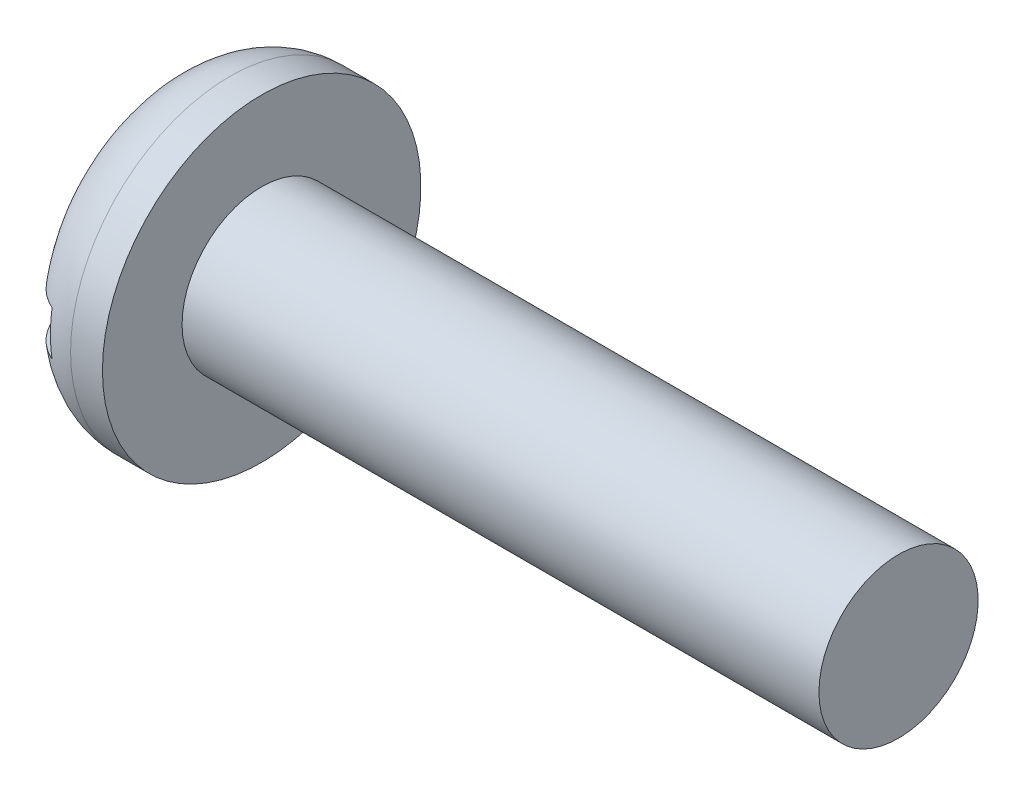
ISO-10303-21;
HEADER;
FILE_DESCRIPTION(('STEP AP214'),'2;1');
FILE_NAME('part.step','',(''),(''),'','','');
FILE_SCHEMA(('AUTOMOTIVE_DESIGN { 1 0 10303 214 1 1 1 1 }'));
ENDSEC;
DATA;
#1=APPLICATION_CONTEXT('core data for automotive mechanical design processes');
#2=APPLICATION_PROTOCOL_DEFINITION('international standard','automotive_design',2000,#1);
#3=PRODUCT_CONTEXT('',#1,'mechanical');
#4=PRODUCT('Part','Part','',(#3));
#5=PRODUCT_RELATED_PRODUCT_CATEGORY('part','',(#4));
#6=PRODUCT_DEFINITION_FORMATION('','',#4);
#7=PRODUCT_DEFINITION_CONTEXT('part definition',#1,'design');
#8=PRODUCT_DEFINITION('design','',#6,#7);
#9=PRODUCT_DEFINITION_SHAPE('','',#8);
#10=(LENGTH_UNIT() NAMED_UNIT(*) SI_UNIT(.MILLI.,.METRE.));
#11=(NAMED_UNIT(*) PLANE_ANGLE_UNIT() SI_UNIT($,.RADIAN.));
#12=(NAMED_UNIT(*) SI_UNIT($,.STERADIAN.) SOLID_ANGLE_UNIT());
#13=UNCERTAINTY_MEASURE_WITH_UNIT(LENGTH_MEASURE(1.E-05),#10,'distance_accuracy_value','');
#14=(GEOMETRIC_REPRESENTATION_CONTEXT(3) GLOBAL_UNCERTAINTY_ASSIGNED_CONTEXT((#13)) GLOBAL_UNIT_ASSIGNED_CONTEXT((#10,
#11,#12)) REPRESENTATION_CONTEXT('',''));
#15=CARTESIAN_POINT('',(0.,0.,0.));
#16=DIRECTION('',(0.,0.,1.));
#17=DIRECTION('',(1.,0.,0.));
#18=AXIS2_PLACEMENT_3D('',#15,#16,#17);
#19=CARTESIAN_POINT('',(0.,0.,0.));
#20=DIRECTION('',(-1.,0.,0.));
#21=DIRECTION('',(0.,0.,1.));
#22=AXIS2_PLACEMENT_3D('',#19,#20,#21);
#23=PLANE('',#22);
#24=DIRECTION('',(0.,0.,-1.));
#25=VECTOR('',#24,1.);
#26=CARTESIAN_POINT('',(0.,1.4,10.));
#27=LINE('',#26,#25);
#28=CARTESIAN_POINT('',(0.,1.4,5.83438085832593));
#29=VERTEX_POINT('',#28);
#30=CARTESIAN_POINT('',(0.,1.4,-5.83438085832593));
#31=VERTEX_POINT('',#30);
#32=EDGE_CURVE('E91',#29,#31,#27,.T.);
#33=ORIENTED_EDGE('',*,*,#32,.F.);
#34=CARTESIAN_POINT('',(0.,0.,0.));
#35=DIRECTION('',(-1.,0.,0.));
#36=DIRECTION('',(0.,0.,1.));
#37=AXIS2_PLACEMENT_3D('',#34,#35,#36);
#38=CIRCLE('',#37,6.);
#39=EDGE_CURVE('E97',#29,#31,#38,.T.);
#40=ORIENTED_EDGE('',*,*,#39,.T.);
#41=EDGE_LOOP('',(#33,#40));
#42=FACE_BOUND('',#41,.T.);
#43=ADVANCED_FACE('F33',(#42),#23,.T.);
#44=CARTESIAN_POINT('',(-25.4,0.,0.));
#45=DIRECTION('',(-1.,0.,0.));
#46=DIRECTION('',(0.,0.,1.));
#47=AXIS2_PLACEMENT_3D('',#44,#45,#46);
#48=CYLINDRICAL_SURFACE('',#47,5.);
#49=CARTESIAN_POINT('',(46.,0.,0.));
#50=DIRECTION('',(-1.,0.,0.));
#51=DIRECTION('',(0.,0.,1.));
#52=AXIS2_PLACEMENT_3D('',#49,#50,#51);
#53=CIRCLE('',#52,5.);
#54=CARTESIAN_POINT('',(46.,0.,5.));
#55=VERTEX_POINT('',#54);
#56=EDGE_CURVE('E101',#55,#55,#53,.T.);
#57=ORIENTED_EDGE('',*,*,#56,.T.);
#58=EDGE_LOOP('',(#57));
#59=FACE_BOUND('',#58,.T.);
#60=CARTESIAN_POINT('',(6.,0.,0.));
#61=DIRECTION('',(-1.,0.,0.));
#62=DIRECTION('',(0.,0.,1.));
#63=AXIS2_PLACEMENT_3D('',#60,#61,#62);
#64=CIRCLE('',#63,5.);
#65=CARTESIAN_POINT('',(6.,0.,5.));
#66=VERTEX_POINT('',#65);
#67=EDGE_CURVE('E136',#66,#66,#64,.T.);
#68=ORIENTED_EDGE('',*,*,#67,.F.);
#69=EDGE_LOOP('',(#68));
#70=FACE_BOUND('',#69,.T.);
#71=ADVANCED_FACE('F35',(#59,#70),#48,.T.);
#72=CARTESIAN_POINT('',(46.,5.,0.));
#73=DIRECTION('',(1.,0.,0.));
#74=DIRECTION('',(0.,0.,-1.));
#75=AXIS2_PLACEMENT_3D('',#72,#73,#74);
#76=PLANE('',#75);
#77=ORIENTED_EDGE('',*,*,#56,.F.);
#78=EDGE_LOOP('',(#77));
#79=FACE_BOUND('',#78,.T.);
#80=ADVANCED_FACE('F155',(#79),#76,.T.);
#81=DIRECTION('',(0.,0.,1.));
#82=VECTOR('',#81,1.);
#83=CARTESIAN_POINT('',(0.,-1.4,-10.));
#84=LINE('',#83,#82);
#85=CARTESIAN_POINT('',(0.,-1.4,-5.83438085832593));
#86=VERTEX_POINT('',#85);
#87=CARTESIAN_POINT('',(0.,-1.4,5.83438085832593));
#88=VERTEX_POINT('',#87);
#89=EDGE_CURVE('E79',#86,#88,#84,.T.);
#90=ORIENTED_EDGE('',*,*,#89,.F.);
#91=EDGE_CURVE('E90',#86,#88,#38,.T.);
#92=ORIENTED_EDGE('',*,*,#91,.T.);
#93=EDGE_LOOP('',(#90,#92));
#94=FACE_BOUND('',#93,.T.);
#95=ADVANCED_FACE('F89',(#94),#23,.T.);
#96=CARTESIAN_POINT('',(4.,0.,0.));
#97=DIRECTION('',(-1.,0.,0.));
#98=DIRECTION('',(0.,0.,1.));
#99=AXIS2_PLACEMENT_3D('',#96,#97,#98);
#100=TOROIDAL_SURFACE('',#99,6.,4.);
#101=CARTESIAN_POINT('',(2.82388760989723,1.4,1.66688763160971));
#102=CARTESIAN_POINT('',(2.99591057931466,1.4,1.59780455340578));
#103=CARTESIAN_POINT('',(3.17324641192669,1.4,1.54138487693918));
#104=CARTESIAN_POINT('',(3.44431983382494,1.4,1.48071678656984));
#105=CARTESIAN_POINT('',(3.53545417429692,1.4,1.46449078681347));
#106=CARTESIAN_POINT('',(3.71886318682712,1.4,1.44064962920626));
#107=CARTESIAN_POINT('',(3.81113770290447,1.4,1.43303330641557));
#108=CARTESIAN_POINT('',(3.99350456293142,1.4,1.42687715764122));
#109=CARTESIAN_POINT('',(4.08358896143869,1.4,1.4280990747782));
#110=CARTESIAN_POINT('',(4.26324158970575,1.4,1.43899537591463));
#111=CARTESIAN_POINT('',(4.3528098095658,1.4,1.44866992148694));
#112=CARTESIAN_POINT('',(4.5308965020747,1.4,1.47606318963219));
#113=CARTESIAN_POINT('',(4.61941221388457,1.4,1.49379966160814));
#114=CARTESIAN_POINT('',(4.79464932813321,1.4,1.53664349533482));
#115=CARTESIAN_POINT('',(4.88137015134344,1.4,1.56175319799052));
#116=CARTESIAN_POINT('',(5.07409548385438,1.4,1.62572381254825));
#117=CARTESIAN_POINT('',(5.17947939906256,1.4,1.66645421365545));
#118=CARTESIAN_POINT('',(5.38629884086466,1.4,1.75692315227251));
#119=CARTESIAN_POINT('',(5.48773323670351,1.4,1.80666424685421));
#120=CARTESIAN_POINT('',(5.68639921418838,1.4,1.9141326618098));
#121=CARTESIAN_POINT('',(5.78362651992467,1.4,1.97186786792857));
#122=CARTESIAN_POINT('',(5.97343201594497,1.4,2.09445578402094));
#123=CARTESIAN_POINT('',(6.06601059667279,1.4,2.15930789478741));
#124=CARTESIAN_POINT('',(6.3410225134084,1.4,2.36717873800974));
#125=CARTESIAN_POINT('',(6.51565728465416,1.4,2.52072958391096));
#126=CARTESIAN_POINT('',(6.84075526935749,1.4,2.85122113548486));
#127=CARTESIAN_POINT('',(6.991232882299,1.4,3.02814779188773));
#128=CARTESIAN_POINT('',(7.28585358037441,1.4,3.43133954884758));
#129=CARTESIAN_POINT('',(7.42540235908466,1.4,3.66100173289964));
#130=CARTESIAN_POINT('',(7.6621109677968,1.4,4.14138729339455));
#131=CARTESIAN_POINT('',(7.75925712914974,1.4,4.39211743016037));
#132=CARTESIAN_POINT('',(7.90345477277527,1.4,4.896570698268));
#133=CARTESIAN_POINT('',(7.95238998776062,1.4,5.14975345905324));
#134=CARTESIAN_POINT('',(8.0041504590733,1.4,5.66077776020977));
#135=CARTESIAN_POINT('',(8.00699532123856,1.4,5.91861727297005));
#136=CARTESIAN_POINT('',(7.96674840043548,1.4,6.41533887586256));
#137=CARTESIAN_POINT('',(7.92635894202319,1.4,6.65444141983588));
#138=CARTESIAN_POINT('',(7.80439510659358,1.4,7.12191135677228));
#139=CARTESIAN_POINT('',(7.72282979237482,1.4,7.35028109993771));
#140=CARTESIAN_POINT('',(7.52443658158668,1.4,7.78063057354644));
#141=CARTESIAN_POINT('',(7.40906711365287,1.4,7.98328350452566));
#142=CARTESIAN_POINT('',(7.14522379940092,1.4,8.36575641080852));
#143=CARTESIAN_POINT('',(6.99675450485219,1.4,8.54557952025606));
#144=CARTESIAN_POINT('',(6.67451507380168,1.4,8.87321576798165));
#145=CARTESIAN_POINT('',(6.50136764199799,1.4,9.02164171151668));
#146=CARTESIAN_POINT('',(6.13235201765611,1.4,9.28688671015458));
#147=CARTESIAN_POINT('',(5.93648551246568,1.4,9.40370811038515));
#148=CARTESIAN_POINT('',(5.53018839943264,1.4,9.60100138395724));
#149=CARTESIAN_POINT('',(5.31996441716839,1.4,9.68189897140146));
#150=CARTESIAN_POINT('',(4.88887041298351,1.4,9.80700967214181));
#151=CARTESIAN_POINT('',(4.66800081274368,1.4,9.85122423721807));
#152=CARTESIAN_POINT('',(4.22332236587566,1.4,9.90150065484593));
#153=CARTESIAN_POINT('',(3.99953945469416,1.4,9.907792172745));
#154=CARTESIAN_POINT('',(3.55410513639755,1.4,9.88265209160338));
#155=CARTESIAN_POINT('',(3.33245369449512,1.4,9.85122110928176));
#156=CARTESIAN_POINT('',(2.89792053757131,1.4,9.75163965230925));
#157=CARTESIAN_POINT('',(2.68502592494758,1.4,9.68354542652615));
#158=CARTESIAN_POINT('',(2.27364991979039,1.4,9.51267018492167));
#159=CARTESIAN_POINT('',(2.07516856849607,1.4,9.40988906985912));
#160=CARTESIAN_POINT('',(1.69766712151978,1.4,9.17232718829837));
#161=CARTESIAN_POINT('',(1.51869880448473,1.4,9.03746416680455));
#162=CARTESIAN_POINT('',(1.18574635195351,1.4,8.7398042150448));
#163=CARTESIAN_POINT('',(1.03176275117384,1.4,8.57700668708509));
#164=CARTESIAN_POINT('',(0.751887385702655,1.4,8.2268843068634));
#165=CARTESIAN_POINT('',(0.626208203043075,1.4,8.03938958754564));
#166=CARTESIAN_POINT('',(0.407636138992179,1.4,7.64619129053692));
#167=CARTESIAN_POINT('',(0.314744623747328,1.4,7.44048695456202));
#168=CARTESIAN_POINT('',(0.162915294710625,1.4,7.01375108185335));
#169=CARTESIAN_POINT('',(0.10445804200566,1.4,6.7925487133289));
#170=CARTESIAN_POINT('',(0.0246071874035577,1.4,6.34357039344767));
#171=CARTESIAN_POINT('',(0.00321715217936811,1.4,6.11579381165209));
#172=CARTESIAN_POINT('',(-0.00260977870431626,1.4,5.65445815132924));
#173=CARTESIAN_POINT('',(0.0138288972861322,1.4,5.42088837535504));
#174=CARTESIAN_POINT('',(0.0842064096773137,1.4,4.95952659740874));
#175=CARTESIAN_POINT('',(0.138146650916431,1.4,4.73173481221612));
#176=CARTESIAN_POINT('',(0.28394368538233,1.4,4.27900664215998));
#177=CARTESIAN_POINT('',(0.377170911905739,1.4,4.05451217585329));
#178=CARTESIAN_POINT('',(0.598005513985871,1.4,3.62307062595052));
#179=CARTESIAN_POINT('',(0.725636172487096,1.4,3.41613555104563));
#180=CARTESIAN_POINT('',(1.01956818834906,1.4,3.01282914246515));
#181=CARTESIAN_POINT('',(1.18768936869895,1.4,2.81777574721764));
#182=CARTESIAN_POINT('',(1.46132201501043,1.4,2.54744642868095));
#183=CARTESIAN_POINT('',(1.55610821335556,1.4,2.46104499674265));
#184=CARTESIAN_POINT('',(1.75234214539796,1.4,2.29618994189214));
#185=CARTESIAN_POINT('',(1.85378794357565,1.4,2.21773402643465));
#186=CARTESIAN_POINT('',(2.09295468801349,1.4,2.04817600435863));
#187=CARTESIAN_POINT('',(2.23271858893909,1.4,1.95992449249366));
#188=CARTESIAN_POINT('',(2.52154246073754,1.4,1.80005555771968));
#189=CARTESIAN_POINT('',(2.67060589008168,1.4,1.72844437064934));
#190=CARTESIAN_POINT('',(2.82388760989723,1.4,1.66688763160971));
#191=B_SPLINE_CURVE_WITH_KNOTS('',3,(#101,#102,#103,#104,#105,#106,#107,#108,#109,#110,#111,
#112,#113,#114,#115,#116,#117,#118,#119,#120,#121,#122,#123,#124,#125,#126,#127,#128,#129,#130,
#131,#132,#133,#134,#135,#136,#137,#138,#139,#140,#141,#142,#143,#144,#145,#146,#147,#148,#149,
#150,#151,#152,#153,#154,#155,#156,#157,#158,#159,#160,#161,#162,#163,#164,#165,#166,#167,#168,
#169,#170,#171,#172,#173,#174,#175,#176,#177,#178,#179,#180,#181,#182,#183,#184,#185,#186,#187,
#188,#189,#190),.UNSPECIFIED.,.T.,.F.,(4,2,2,2,2,2,2,2,2,2,2,2,2,2,2,2,2,2,2,2,2,2,2,2,2,2,2,2,
2,2,2,2,2,2,2,2,2,2,2,2,2,2,2,2,4),(0.,0.555533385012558,0.832895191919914,1.11021946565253,
1.38009618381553,1.64997806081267,1.92045701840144,2.19102194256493,2.52946853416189,
2.86801132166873,3.20689047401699,3.54574111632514,4.24063810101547,4.93511932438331,
5.73720882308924,6.53955668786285,7.30913863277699,8.07839320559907,8.80222860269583,
9.52590475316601,10.222069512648,10.9181385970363,11.599020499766,12.279851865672,
12.9523844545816,13.6248904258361,14.2933195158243,14.961737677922,15.6291332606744,
16.2965307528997,16.9656581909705,17.6347999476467,18.3088111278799,18.9828503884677,
19.6660863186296,20.3493879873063,21.048663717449,21.7479656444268,22.4739960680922,
23.2005190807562,23.9693716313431,24.3537991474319,24.7381154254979,25.2329404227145,
25.7279505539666),.UNSPECIFIED.);
#192=CARTESIAN_POINT('',(2.4,1.4,9.56413752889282));
#193=VERTEX_POINT('',#192);
#194=EDGE_CURVE('E11',#193,#29,#191,.T.);
#195=ORIENTED_EDGE('',*,*,#194,.F.);
#196=CARTESIAN_POINT('',(2.4,0.,0.));
#197=DIRECTION('',(1.,0.,0.));
#198=DIRECTION('',(0.,0.,-1.));
#199=AXIS2_PLACEMENT_3D('',#196,#197,#198);
#200=CIRCLE('',#199,9.66606055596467);
#201=CARTESIAN_POINT('',(2.4,-1.4,9.56413752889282));
#202=VERTEX_POINT('',#201);
#203=EDGE_CURVE('E109',#202,#193,#200,.F.);
#204=ORIENTED_EDGE('',*,*,#203,.F.);
#205=CARTESIAN_POINT('',(2.82388760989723,-1.4,1.66688763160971));
#206=CARTESIAN_POINT('',(2.71540202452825,-1.4,1.71047129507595));
#207=CARTESIAN_POINT('',(2.60898579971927,-1.4,1.75910359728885));
#208=CARTESIAN_POINT('',(2.40061681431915,-1.4,1.8652179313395));
#209=CARTESIAN_POINT('',(2.29866610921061,-1.4,1.92270398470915));
#210=CARTESIAN_POINT('',(2.09948783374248,-1.4,2.04561495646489));
#211=CARTESIAN_POINT('',(2.00226689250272,-1.4,2.11105059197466));
#212=CARTESIAN_POINT('',(1.81307952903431,-1.4,2.2490440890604));
#213=CARTESIAN_POINT('',(1.72111244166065,-1.4,2.32160104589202));
#214=CARTESIAN_POINT('',(1.44651086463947,-1.4,2.55519423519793));
#215=CARTESIAN_POINT('',(1.27305430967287,-1.4,2.72726611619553));
#216=CARTESIAN_POINT('',(0.954530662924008,-1.4,3.0956226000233));
#217=CARTESIAN_POINT('',(0.809446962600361,-1.4,3.29189292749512));
#218=CARTESIAN_POINT('',(0.539044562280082,-1.4,3.72510352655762));
#219=CARTESIAN_POINT('',(0.41705555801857,-1.4,3.96414444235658));
#220=CARTESIAN_POINT('',(0.217486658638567,-1.4,4.46022105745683));
#221=CARTESIAN_POINT('',(0.139912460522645,-1.4,4.71725906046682));
#222=CARTESIAN_POINT('',(0.036055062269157,-1.4,5.22733248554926));
#223=CARTESIAN_POINT('',(0.00727059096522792,-1.4,5.47985761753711));
#224=CARTESIAN_POINT('',(-0.00483928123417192,-1.4,5.98598968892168));
#225=CARTESIAN_POINT('',(0.0118179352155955,-1.4,6.23959617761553));
#226=CARTESIAN_POINT('',(0.0887000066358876,-1.4,6.7257703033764));
#227=CARTESIAN_POINT('',(0.146473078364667,-1.4,6.95872713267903));
#228=CARTESIAN_POINT('',(0.301685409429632,-1.4,7.41103618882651));
#229=CARTESIAN_POINT('',(0.39911653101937,-1.4,7.63039119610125));
#230=CARTESIAN_POINT('',(0.627106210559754,-1.4,8.0414555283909));
#231=CARTESIAN_POINT('',(0.756432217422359,-1.4,8.23384917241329));
#232=CARTESIAN_POINT('',(1.04614095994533,-1.4,8.59363288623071));
#233=CARTESIAN_POINT('',(1.20652002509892,-1.4,8.76102590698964));
#234=CARTESIAN_POINT('',(1.55036681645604,-1.4,9.06271575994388));
#235=CARTESIAN_POINT('',(1.73332861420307,-1.4,9.1975895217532));
#236=CARTESIAN_POINT('',(2.1194964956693,-1.4,9.43431460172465));
#237=CARTESIAN_POINT('',(2.32270123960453,-1.4,9.53616810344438));
#238=CARTESIAN_POINT('',(2.74123726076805,-1.4,9.70289102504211));
#239=CARTESIAN_POINT('',(2.95641615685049,-1.4,9.76814316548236));
#240=CARTESIAN_POINT('',(3.3946994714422,-1.4,9.86139308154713));
#241=CARTESIAN_POINT('',(3.6178036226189,-1.4,9.88939211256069));
#242=CARTESIAN_POINT('',(4.06441079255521,-1.4,9.90726099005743));
#243=CARTESIAN_POINT('',(4.28790623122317,-1.4,9.89732089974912));
#244=CARTESIAN_POINT('',(4.73004701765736,-1.4,9.84003162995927));
#245=CARTESIAN_POINT('',(4.9486924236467,-1.4,9.79268289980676));
#246=CARTESIAN_POINT('',(5.3747961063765,-1.4,9.66201128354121));
#247=CARTESIAN_POINT('',(5.58226150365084,-1.4,9.57871160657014));
#248=CARTESIAN_POINT('',(5.98032786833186,-1.4,9.37858070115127));
#249=CARTESIAN_POINT('',(6.17092872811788,-1.4,9.26174925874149));
#250=CARTESIAN_POINT('',(6.53061319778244,-1.4,8.99748598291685));
#251=CARTESIAN_POINT('',(6.69961881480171,-1.4,8.84994802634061));
#252=CARTESIAN_POINT('',(7.01070808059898,-1.4,8.52880560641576));
#253=CARTESIAN_POINT('',(7.15279100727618,-1.4,8.35520044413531));
#254=CARTESIAN_POINT('',(7.40735991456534,-1.4,7.98533317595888));
#255=CARTESIAN_POINT('',(7.51958543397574,-1.4,7.78889187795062));
#256=CARTESIAN_POINT('',(7.71001696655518,-1.4,7.38017669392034));
#257=CARTESIAN_POINT('',(7.78822142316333,-1.4,7.16790208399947));
#258=CARTESIAN_POINT('',(7.90980483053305,-1.4,6.73009505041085));
#259=CARTESIAN_POINT('',(7.95262978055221,-1.4,6.50440895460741));
#260=CARTESIAN_POINT('',(8.00079716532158,-1.4,6.04909194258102));
#261=CARTESIAN_POINT('',(8.00613567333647,-1.4,5.8194606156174));
#262=CARTESIAN_POINT('',(7.97952886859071,-1.4,5.35637788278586));
#263=CARTESIAN_POINT('',(7.94660783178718,-1.4,5.12298297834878));
#264=CARTESIAN_POINT('',(7.84366216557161,-1.4,4.66457814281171));
#265=CARTESIAN_POINT('',(7.77363428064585,-1.4,4.4395689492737));
#266=CARTESIAN_POINT('',(7.59554777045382,-1.4,3.99405428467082));
#267=CARTESIAN_POINT('',(7.48600437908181,-1.4,3.77414292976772));
#268=CARTESIAN_POINT('',(7.23359578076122,-1.4,3.35435833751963));
#269=CARTESIAN_POINT('',(7.09071366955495,-1.4,3.15449533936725));
#270=CARTESIAN_POINT('',(6.76629368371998,-1.4,2.76755988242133));
#271=CARTESIAN_POINT('',(6.58293445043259,-1.4,2.58200264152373));
#272=CARTESIAN_POINT('',(6.28727477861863,-1.4,2.32796845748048));
#273=CARTESIAN_POINT('',(6.18520562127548,-1.4,2.24729246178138));
#274=CARTESIAN_POINT('',(5.97464493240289,-1.4,2.09477363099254));
#275=CARTESIAN_POINT('',(5.86615500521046,-1.4,2.02292860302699));
#276=CARTESIAN_POINT('',(5.66925974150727,-1.4,1.90473580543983));
#277=CARTESIAN_POINT('',(5.5820759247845,-1.4,1.85635056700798));
#278=CARTESIAN_POINT('',(5.40447794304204,-1.4,1.76601481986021));
#279=CARTESIAN_POINT('',(5.3140639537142,-1.4,1.72406396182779));
#280=CARTESIAN_POINT('',(5.03859810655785,-1.4,1.60919639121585));
#281=CARTESIAN_POINT('',(4.84876547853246,-1.4,1.5469220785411));
#282=CARTESIAN_POINT('',(4.57410858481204,-1.4,1.48460548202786));
#283=CARTESIAN_POINT('',(4.4925383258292,-1.4,1.46944399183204));
#284=CARTESIAN_POINT('',(4.32843200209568,-1.4,1.44597569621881));
#285=CARTESIAN_POINT('',(4.24589649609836,-1.4,1.43766510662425));
#286=CARTESIAN_POINT('',(4.08047397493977,-1.4,1.42822487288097));
#287=CARTESIAN_POINT('',(3.99758725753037,-1.4,1.42709003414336));
#288=CARTESIAN_POINT('',(3.83204246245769,-1.4,1.43202135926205));
#289=CARTESIAN_POINT('',(3.74938438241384,-1.4,1.43808744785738));
#290=CARTESIAN_POINT('',(3.52259683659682,-1.4,1.46445228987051));
#291=CARTESIAN_POINT('',(3.37927427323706,-1.4,1.49204691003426));
#292=CARTESIAN_POINT('',(3.09752035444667,-1.4,1.566090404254));
#293=CARTESIAN_POINT('',(2.95909676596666,-1.4,1.61256787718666));
#294=CARTESIAN_POINT('',(2.82388760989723,-1.4,1.66688763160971));
#295=B_SPLINE_CURVE_WITH_KNOTS('',3,(#205,#206,#207,#208,#209,#210,#211,#212,#213,#214,#215,
#216,#217,#218,#219,#220,#221,#222,#223,#224,#225,#226,#227,#228,#229,#230,#231,#232,#233,#234,
#235,#236,#237,#238,#239,#240,#241,#242,#243,#244,#245,#246,#247,#248,#249,#250,#251,#252,#253,
#254,#255,#256,#257,#258,#259,#260,#261,#262,#263,#264,#265,#266,#267,#268,#269,#270,#271,#272,
#273,#274,#275,#276,#277,#278,#279,#280,#281,#282,#283,#284,#285,#286,#287,#288,#289,#290,#291,
#292,#293,#294),.UNSPECIFIED.,.T.,.F.,(4,2,2,2,2,2,2,2,2,2,2,2,2,2,2,2,2,2,2,2,2,2,2,2,2,2,2,2,
2,2,2,2,2,2,2,2,2,2,2,2,2,2,2,2,4),(0.,0.350573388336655,0.701306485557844,1.05251777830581,
1.40368450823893,2.13355222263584,2.86299140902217,3.663905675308,4.46492265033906,
5.22347169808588,5.98173062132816,6.69819887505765,7.41452018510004,8.10660215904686,
8.79860237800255,9.47723334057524,10.1558194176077,10.827170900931,11.4984997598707,
12.1664698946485,12.8344320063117,13.5019635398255,14.1694993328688,14.8393816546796,
15.5092819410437,16.1848475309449,16.8604440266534,17.546429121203,18.2324860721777,
18.9364304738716,19.6404366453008,20.3742522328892,21.1084407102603,21.8872427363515,
22.2771931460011,22.6670465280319,22.9659181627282,23.2647735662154,23.8605401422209,
24.1092214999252,24.3577654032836,24.6061293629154,24.8544907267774,25.290758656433,
25.7276898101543),.UNSPECIFIED.);
#296=EDGE_CURVE('E46',#88,#202,#295,.T.);
#297=ORIENTED_EDGE('',*,*,#296,.F.);
#298=ORIENTED_EDGE('',*,*,#91,.F.);
#299=CARTESIAN_POINT('',(1.60255767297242,-1.4,-9.09479357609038));
#300=CARTESIAN_POINT('',(1.42201008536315,-1.4,-8.95800797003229));
#301=CARTESIAN_POINT('',(1.25307546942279,-1.4,-8.80577767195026));
#302=CARTESIAN_POINT('',(0.943242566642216,-1.4,-8.4749624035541));
#303=CARTESIAN_POINT('',(0.802359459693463,-1.4,-8.29636325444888));
#304=CARTESIAN_POINT('',(0.552596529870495,-1.4,-7.91824740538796));
#305=CARTESIAN_POINT('',(0.443691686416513,-1.4,-7.71874722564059));
#306=CARTESIAN_POINT('',(0.260496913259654,-1.4,-7.30449201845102));
#307=CARTESIAN_POINT('',(0.186203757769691,-1.4,-7.08973841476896));
#308=CARTESIAN_POINT('',(0.0731519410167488,-1.4,-6.64832941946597));
#309=CARTESIAN_POINT('',(0.0348321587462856,-1.4,-6.42156181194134));
#310=CARTESIAN_POINT('',(-0.00424272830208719,-1.4,-5.96482904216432));
#311=CARTESIAN_POINT('',(-0.00499316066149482,-1.4,-5.73486348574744));
#312=CARTESIAN_POINT('',(0.0308667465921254,-1.4,-5.27164914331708));
#313=CARTESIAN_POINT('',(0.068484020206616,-1.4,-5.0384787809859));
#314=CARTESIAN_POINT('',(0.180679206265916,-1.4,-4.58126704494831));
#315=CARTESIAN_POINT('',(0.255259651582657,-1.4,-4.35722629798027));
#316=CARTESIAN_POINT('',(0.442477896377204,-1.4,-3.91412338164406));
#317=CARTESIAN_POINT('',(0.556629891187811,-1.4,-3.69570158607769));
#318=CARTESIAN_POINT('',(0.817950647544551,-1.4,-3.27956502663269));
#319=CARTESIAN_POINT('',(0.965139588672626,-1.4,-3.08186302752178));
#320=CARTESIAN_POINT('',(1.29817914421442,-1.4,-2.69992259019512));
#321=CARTESIAN_POINT('',(1.48584947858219,-1.4,-2.51725759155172));
#322=CARTESIAN_POINT('',(1.78770407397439,-1.4,-2.26826503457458));
#323=CARTESIAN_POINT('',(1.89178677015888,-1.4,-2.18939264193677));
#324=CARTESIAN_POINT('',(2.1063041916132,-1.4,-2.04077370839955));
#325=CARTESIAN_POINT('',(2.21673709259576,-1.4,-1.97102456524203));
#326=CARTESIAN_POINT('',(2.41459328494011,-1.4,-1.85824654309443));
#327=CARTESIAN_POINT('',(2.5007224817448,-1.4,-1.8129343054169));
#328=CARTESIAN_POINT('',(2.67606955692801,-1.4,-1.72862585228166));
#329=CARTESIAN_POINT('',(2.76528827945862,-1.4,-1.68963137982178));
#330=CARTESIAN_POINT('',(2.94631404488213,-1.4,-1.61884234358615));
#331=CARTESIAN_POINT('',(3.03811459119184,-1.4,-1.58703125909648));
#332=CARTESIAN_POINT('',(3.22407188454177,-1.4,-1.53141978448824));
#333=CARTESIAN_POINT('',(3.31822699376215,-1.4,-1.50761398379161));
#334=CARTESIAN_POINT('',(3.49434437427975,-1.4,-1.47176051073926));
#335=CARTESIAN_POINT('',(3.57605897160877,-1.4,-1.4584971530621));
#336=CARTESIAN_POINT('',(3.74031547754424,-1.4,-1.438907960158));
#337=CARTESIAN_POINT('',(3.82285726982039,-1.4,-1.4325811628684));
#338=CARTESIAN_POINT('',(3.98813480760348,-1.4,-1.42711628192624));
#339=CARTESIAN_POINT('',(4.07087042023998,-1.4,-1.42797421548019));
#340=CARTESIAN_POINT('',(4.23595842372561,-1.4,-1.43683362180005));
#341=CARTESIAN_POINT('',(4.31831079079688,-1.4,-1.44483553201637));
#342=CARTESIAN_POINT('',(4.48166303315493,-1.4,-1.46761888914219));
#343=CARTESIAN_POINT('',(4.56266750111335,-1.4,-1.48236763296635));
#344=CARTESIAN_POINT('',(4.72328923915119,-1.4,-1.51814503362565));
#345=CARTESIAN_POINT('',(4.80290588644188,-1.4,-1.53917643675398));
#346=CARTESIAN_POINT('',(5.03940009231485,-1.4,-1.61091872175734));
#347=CARTESIAN_POINT('',(5.19372287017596,-1.4,-1.67024755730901));
#348=CARTESIAN_POINT('',(5.45636530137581,-1.4,-1.79049182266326));
#349=CARTESIAN_POINT('',(5.56660362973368,-1.4,-1.84736620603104));
#350=CARTESIAN_POINT('',(5.78184901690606,-1.4,-1.97038786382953));
#351=CARTESIAN_POINT('',(5.88685392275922,-1.4,-2.03653891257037));
#352=CARTESIAN_POINT('',(6.09120381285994,-1.4,-2.17715875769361));
#353=CARTESIAN_POINT('',(6.19054579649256,-1.4,-2.25163190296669));
#354=CARTESIAN_POINT('',(6.38308984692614,-1.4,-2.40815422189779));
#355=CARTESIAN_POINT('',(6.47628952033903,-1.4,-2.49020631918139));
#356=CARTESIAN_POINT('',(6.74852639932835,-1.4,-2.74935686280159));
#357=CARTESIAN_POINT('',(6.91732908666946,-1.4,-2.93746304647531));
#358=CARTESIAN_POINT('',(7.2227588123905,-1.4,-3.33792131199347));
#359=CARTESIAN_POINT('',(7.3594051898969,-1.4,-3.55025870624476));
#360=CARTESIAN_POINT('',(7.60262273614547,-1.4,-4.00684687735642));
#361=CARTESIAN_POINT('',(7.70712340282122,-1.4,-4.25221113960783));
#362=CARTESIAN_POINT('',(7.87054002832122,-1.4,-4.75778277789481));
#363=CARTESIAN_POINT('',(7.92945417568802,-1.4,-5.01799074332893));
#364=CARTESIAN_POINT('',(7.9963072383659,-1.4,-5.52923174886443));
#365=CARTESIAN_POINT('',(8.00705429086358,-1.4,-5.77989754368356));
#366=CARTESIAN_POINT('',(7.98392268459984,-1.4,-6.27915375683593));
#367=CARTESIAN_POINT('',(7.95006039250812,-1.4,-6.5277449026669));
#368=CARTESIAN_POINT('',(7.84092880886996,-1.4,-7.00233390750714));
#369=CARTESIAN_POINT('',(7.76785410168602,-1.4,-7.22883775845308));
#370=CARTESIAN_POINT('',(7.58353421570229,-1.4,-7.66575004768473));
#371=CARTESIAN_POINT('',(7.47229592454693,-1.4,-7.87616138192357));
#372=CARTESIAN_POINT('',(7.21862966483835,-1.4,-8.26820925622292));
#373=CARTESIAN_POINT('',(7.07725134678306,-1.4,-8.45052554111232));
#374=CARTESIAN_POINT('',(6.76540228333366,-1.4,-8.78830249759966));
#375=CARTESIAN_POINT('',(6.59493462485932,-1.4,-8.9437660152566));
#376=CARTESIAN_POINT('',(6.23297619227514,-1.4,-9.22066727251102));
#377=CARTESIAN_POINT('',(6.04189906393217,-1.4,-9.34264598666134));
#378=CARTESIAN_POINT('',(5.64183077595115,-1.4,-9.55243700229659));
#379=CARTESIAN_POINT('',(5.43284089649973,-1.4,-9.64025174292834));
#380=CARTESIAN_POINT('',(5.00500779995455,-1.4,-9.77842699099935));
#381=CARTESIAN_POINT('',(4.78627596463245,-1.4,-9.82913257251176));
#382=CARTESIAN_POINT('',(4.34337250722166,-1.4,-9.89293876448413));
#383=CARTESIAN_POINT('',(4.11920052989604,-1.4,-9.90603691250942));
#384=CARTESIAN_POINT('',(3.67274189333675,-1.4,-9.8942603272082));
#385=CARTESIAN_POINT('',(3.45045129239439,-1.4,-9.8695331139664));
#386=CARTESIAN_POINT('',(3.01325852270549,-1.4,-9.78310730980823));
#387=CARTESIAN_POINT('',(2.79835276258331,-1.4,-9.72142696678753));
#388=CARTESIAN_POINT('',(2.41367411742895,-1.4,-9.57504093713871));
#389=CARTESIAN_POINT('',(2.242006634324,-1.4,-9.49526102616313));
#390=CARTESIAN_POINT('',(1.91172045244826,-1.4,-9.31216498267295));
#391=CARTESIAN_POINT('',(1.75310205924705,-1.4,-9.20884829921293));
#392=CARTESIAN_POINT('',(1.60255767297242,-1.4,-9.09479357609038));
#393=B_SPLINE_CURVE_WITH_KNOTS('',3,(#299,#300,#301,#302,#303,#304,#305,#306,#307,#308,#309,
#310,#311,#312,#313,#314,#315,#316,#317,#318,#319,#320,#321,#322,#323,#324,#325,#326,#327,#328,
#329,#330,#331,#332,#333,#334,#335,#336,#337,#338,#339,#340,#341,#342,#343,#344,#345,#346,#347,
#348,#349,#350,#351,#352,#353,#354,#355,#356,#357,#358,#359,#360,#361,#362,#363,#364,#365,#366,
#367,#368,#369,#370,#371,#372,#373,#374,#375,#376,#377,#378,#379,#380,#381,#382,#383,#384,#385,
#386,#387,#388,#389,#390,#391,#392),.UNSPECIFIED.,.T.,.F.,(4,2,2,2,2,2,2,2,2,2,2,2,2,2,2,2,2,2,
2,2,2,2,2,2,2,2,2,2,2,2,2,2,2,2,2,2,2,2,2,2,2,2,2,2,2,2,4),(0.,0.678849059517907,
1.35806448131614,2.03674704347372,2.71536634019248,3.40216119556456,4.08904146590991,
4.79442427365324,5.4998554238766,6.23596892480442,6.97253328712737,7.75435096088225,
8.14576003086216,8.5370572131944,8.82880140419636,9.12062594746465,9.411772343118,
9.70272156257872,9.95079958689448,10.1988431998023,10.4467493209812,10.6946706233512,
10.9414027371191,11.1882428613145,11.6825210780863,12.0542404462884,12.4261114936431,
12.7981777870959,13.1703882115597,13.9251731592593,14.6795030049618,15.4753713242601,
16.2712712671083,17.0201104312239,17.7686749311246,18.4791502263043,19.1894973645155,
19.8782746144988,20.5669788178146,21.2437959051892,21.9205646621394,22.5909573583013,
23.261393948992,23.9292224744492,24.5967214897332,25.1627469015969,25.7287855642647),.UNSPECIFIED.);
#394=CARTESIAN_POINT('',(2.4,-1.4,-9.56413752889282));
#395=VERTEX_POINT('',#394);
#396=EDGE_CURVE('E76',#395,#86,#393,.T.);
#397=ORIENTED_EDGE('',*,*,#396,.F.);
#398=CARTESIAN_POINT('',(2.4,1.4,-9.56413752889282));
#399=VERTEX_POINT('',#398);
#400=EDGE_CURVE('E85',#399,#395,#200,.F.);
#401=ORIENTED_EDGE('',*,*,#400,.F.);
#402=CARTESIAN_POINT('',(1.60255767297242,1.4,-9.09479357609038));
#403=CARTESIAN_POINT('',(1.78042975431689,1.4,-9.2295281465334));
#404=CARTESIAN_POINT('',(1.96978024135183,1.4,-9.34943426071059));
#405=CARTESIAN_POINT('',(2.3660869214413,1.4,-9.55589063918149));
#406=CARTESIAN_POINT('',(2.57306606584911,1.4,-9.6423965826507));
#407=CARTESIAN_POINT('',(2.99857871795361,1.4,-9.77934410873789));
#408=CARTESIAN_POINT('',(3.21710812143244,1.4,-9.82979841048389));
#409=CARTESIAN_POINT('',(3.65947725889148,1.4,-9.89316848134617));
#410=CARTESIAN_POINT('',(3.8833154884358,1.4,-9.90609476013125));
#411=CARTESIAN_POINT('',(4.32937519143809,1.4,-9.89407937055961));
#412=CARTESIAN_POINT('',(4.55159938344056,1.4,-9.86923849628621));
#413=CARTESIAN_POINT('',(4.9887293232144,1.4,-9.78260260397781));
#414=CARTESIAN_POINT('',(5.2036348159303,1.4,-9.7208062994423));
#415=CARTESIAN_POINT('',(5.62007554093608,1.4,-9.56206071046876));
#416=CARTESIAN_POINT('',(5.82160882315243,1.4,-9.46510631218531));
#417=CARTESIAN_POINT('',(6.20562912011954,1.4,-9.23887975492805));
#418=CARTESIAN_POINT('',(6.38811599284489,1.4,-9.10960735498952));
#419=CARTESIAN_POINT('',(6.72976890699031,1.4,-8.82185956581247));
#420=CARTESIAN_POINT('',(6.88882880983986,1.4,-8.66325819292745));
#421=CARTESIAN_POINT('',(7.17836018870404,1.4,-8.32182621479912));
#422=CARTESIAN_POINT('',(7.30883080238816,1.4,-8.13899487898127));
#423=CARTESIAN_POINT('',(7.53890520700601,1.4,-7.75246121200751));
#424=CARTESIAN_POINT('',(7.63819977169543,1.4,-7.54857491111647));
#425=CARTESIAN_POINT('',(7.80178101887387,1.4,-7.12723102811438));
#426=CARTESIAN_POINT('',(7.86606602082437,1.4,-6.90977279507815));
#427=CARTESIAN_POINT('',(7.95912225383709,1.4,-6.46351200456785));
#428=CARTESIAN_POINT('',(7.98726680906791,1.4,-6.234578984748));
#429=CARTESIAN_POINT('',(8.00584678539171,1.4,-5.77520536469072));
#430=CARTESIAN_POINT('',(7.99627710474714,1.4,-5.5447645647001));
#431=CARTESIAN_POINT('',(7.93962048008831,1.4,-5.08181122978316));
#432=CARTESIAN_POINT('',(7.89145923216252,1.4,-4.84943069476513));
#433=CARTESIAN_POINT('',(7.75854423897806,1.4,-4.39545851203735));
#434=CARTESIAN_POINT('',(7.67378960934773,1.4,-4.1738671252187));
#435=CARTESIAN_POINT('',(7.4661616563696,1.4,-3.73672348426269));
#436=CARTESIAN_POINT('',(7.34171040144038,1.4,-3.52192124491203));
#437=CARTESIAN_POINT('',(7.06049449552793,1.4,-3.11452077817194));
#438=CARTESIAN_POINT('',(6.90370203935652,1.4,-2.92194188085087));
#439=CARTESIAN_POINT('',(6.55152008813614,1.4,-2.55193442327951));
#440=CARTESIAN_POINT('',(6.35433356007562,1.4,-2.37619922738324));
#441=CARTESIAN_POINT('',(6.03880372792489,1.4,-2.13930999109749));
#442=CARTESIAN_POINT('',(5.930277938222,1.4,-2.06476947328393));
#443=CARTESIAN_POINT('',(5.70704385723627,1.4,-1.92555719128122));
#444=CARTESIAN_POINT('',(5.59233792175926,1.4,-1.86088170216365));
#445=CARTESIAN_POINT('',(5.39211678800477,1.4,-1.76031232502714));
#446=CARTESIAN_POINT('',(5.30802347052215,1.4,-1.72156870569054));
#447=CARTESIAN_POINT('',(5.13720265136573,1.4,-1.65029049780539));
#448=CARTESIAN_POINT('',(5.05047460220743,1.4,-1.61775721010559));
#449=CARTESIAN_POINT('',(4.87493674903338,1.4,-1.55975005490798));
#450=CARTESIAN_POINT('',(4.78613329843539,1.4,-1.53425709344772));
#451=CARTESIAN_POINT('',(4.60669151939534,1.4,-1.49103175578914));
#452=CARTESIAN_POINT('',(4.51605426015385,1.4,-1.4732949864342));
#453=CARTESIAN_POINT('',(4.3325663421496,1.4,-1.44614573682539));
#454=CARTESIAN_POINT('',(4.23970248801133,1.4,-1.4368212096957));
#455=CARTESIAN_POINT('',(4.05351092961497,1.4,-1.42727208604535));
#456=CARTESIAN_POINT('',(3.96018326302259,1.4,-1.4270467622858));
#457=CARTESIAN_POINT('',(3.7738555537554,1.4,-1.43571361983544));
#458=CARTESIAN_POINT('',(3.68085594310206,1.4,-1.44461511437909));
#459=CARTESIAN_POINT('',(3.49612734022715,1.4,-1.47109765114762));
#460=CARTESIAN_POINT('',(3.40439858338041,1.4,-1.48868027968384));
#461=CARTESIAN_POINT('',(3.11176900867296,1.4,-1.55819402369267));
#462=CARTESIAN_POINT('',(2.91443474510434,1.4,-1.62584330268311));
#463=CARTESIAN_POINT('',(2.62873446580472,1.4,-1.75012380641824));
#464=CARTESIAN_POINT('',(2.53506897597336,1.4,-1.79544734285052));
#465=CARTESIAN_POINT('',(2.35131494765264,1.4,-1.89293017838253));
#466=CARTESIAN_POINT('',(2.26122663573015,1.4,-1.94508990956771));
#467=CARTESIAN_POINT('',(2.06109825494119,1.4,-2.07049902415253));
#468=CARTESIAN_POINT('',(1.95224243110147,1.4,-2.14563923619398));
#469=CARTESIAN_POINT('',(1.74128623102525,1.4,-2.30484009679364));
#470=CARTESIAN_POINT('',(1.63918726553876,1.4,-2.38890259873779));
#471=CARTESIAN_POINT('',(1.34404347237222,1.4,-2.6531906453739));
#472=CARTESIAN_POINT('',(1.16180033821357,1.4,-2.84573983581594));
#473=CARTESIAN_POINT('',(0.831222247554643,1.4,-3.25920012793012));
#474=CARTESIAN_POINT('',(0.683005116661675,1.4,-3.48020576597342));
#475=CARTESIAN_POINT('',(0.490891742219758,1.4,-3.82815301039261));
#476=CARTESIAN_POINT('',(0.431868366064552,1.4,-3.94693591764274));
#477=CARTESIAN_POINT('',(0.324488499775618,1.4,-4.18921047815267));
#478=CARTESIAN_POINT('',(0.276127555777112,1.4,-4.31270013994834));
#479=CARTESIAN_POINT('',(0.191562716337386,1.4,-4.56077513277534));
#480=CARTESIAN_POINT('',(0.155117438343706,1.4,-4.68527831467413));
#481=CARTESIAN_POINT('',(0.0934293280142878,1.4,-4.93698111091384));
#482=CARTESIAN_POINT('',(0.0681816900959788,1.4,-5.06417954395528));
#483=CARTESIAN_POINT('',(0.0292289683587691,1.4,-5.32033658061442));
#484=CARTESIAN_POINT('',(0.0155240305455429,1.4,-5.44929520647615));
#485=CARTESIAN_POINT('',(-8.31529471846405E-05,1.4,-5.70792154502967));
#486=CARTESIAN_POINT('',(-0.00198632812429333,1.4,-5.83758920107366));
#487=CARTESIAN_POINT('',(0.00590653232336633,1.4,-6.08866537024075));
#488=CARTESIAN_POINT('',(0.0149978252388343,1.4,-6.21009639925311));
#489=CARTESIAN_POINT('',(0.0437445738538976,1.4,-6.4516978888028));
#490=CARTESIAN_POINT('',(0.0633992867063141,1.4,-6.57186843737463));
#491=CARTESIAN_POINT('',(0.113214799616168,1.4,-6.81005241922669));
#492=CARTESIAN_POINT('',(0.143378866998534,1.4,-6.92806516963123));
#493=CARTESIAN_POINT('',(0.214036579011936,1.4,-7.16090604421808));
#494=CARTESIAN_POINT('',(0.254525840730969,1.4,-7.27573549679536));
#495=CARTESIAN_POINT('',(0.343759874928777,1.4,-7.49681283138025));
#496=CARTESIAN_POINT('',(0.392109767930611,1.4,-7.60322025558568));
#497=CARTESIAN_POINT('',(0.497766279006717,1.4,-7.81143762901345));
#498=CARTESIAN_POINT('',(0.555069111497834,1.4,-7.91324949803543));
#499=CARTESIAN_POINT('',(0.678186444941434,1.4,-8.11142156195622));
#500=CARTESIAN_POINT('',(0.743990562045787,1.4,-8.20778820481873));
#501=CARTESIAN_POINT('',(0.88367566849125,1.4,-8.39442269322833));
#502=CARTESIAN_POINT('',(0.957553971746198,1.4,-8.48469255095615));
#503=CARTESIAN_POINT('',(1.12107819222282,1.4,-8.66763294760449));
#504=CARTESIAN_POINT('',(1.21156527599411,1.4,-8.75955486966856));
#505=CARTESIAN_POINT('',(1.40094478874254,1.4,-8.93423081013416));
#506=CARTESIAN_POINT('',(1.49983719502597,1.4,-9.01698485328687));
#507=CARTESIAN_POINT('',(1.60255767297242,1.4,-9.09479357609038));
#508=B_SPLINE_CURVE_WITH_KNOTS('',3,(#402,#403,#404,#405,#406,#407,#408,#409,#410,#411,#412,
#413,#414,#415,#416,#417,#418,#419,#420,#421,#422,#423,#424,#425,#426,#427,#428,#429,#430,#431,
#432,#433,#434,#435,#436,#437,#438,#439,#440,#441,#442,#443,#444,#445,#446,#447,#448,#449,#450,
#451,#452,#453,#454,#455,#456,#457,#458,#459,#460,#461,#462,#463,#464,#465,#466,#467,#468,#469,
#470,#471,#472,#473,#474,#475,#476,#477,#478,#479,#480,#481,#482,#483,#484,#485,#486,#487,#488,
#489,#490,#491,#492,#493,#494,#495,#496,#497,#498,#499,#500,#501,#502,#503,#504,#505,#506,#507),
.UNSPECIFIED.,.T.,.F.,(4,2,2,2,2,2,2,2,2,2,2,2,2,2,2,2,2,2,2,2,2,2,2,2,2,2,2,2,2,2,2,2,2,2,2,2,
2,2,2,2,2,2,2,2,2,2,2,2,2,2,2,2,4),(0.,0.668971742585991,1.338828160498,2.00844813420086,
2.67788056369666,3.34552952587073,4.01320173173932,4.68097109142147,5.34874543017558,
6.01945781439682,6.69019042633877,7.36737976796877,8.04460161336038,8.73341459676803,
9.42232076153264,10.1310999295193,10.8398962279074,11.5813863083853,12.3235165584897,
13.1119202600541,13.5065055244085,13.9009414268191,14.1784994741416,14.4561155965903,
14.7329712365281,15.0096698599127,15.2892290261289,15.5687658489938,15.848588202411,
16.1284617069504,16.7503351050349,17.0623237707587,17.3743321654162,17.7706239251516,
18.1669981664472,18.9585132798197,19.7527292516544,20.1502172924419,20.5475389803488,
20.9362250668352,21.3247441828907,21.7132682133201,22.1017616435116,22.4666188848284,
22.8314504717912,23.1963955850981,23.5611860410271,23.9113888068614,24.2614438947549,
24.6110753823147,24.9605909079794,25.346920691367,25.7332494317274),.UNSPECIFIED.);
#509=EDGE_CURVE('E84',#31,#399,#508,.T.);
#510=ORIENTED_EDGE('',*,*,#509,.F.);
#511=ORIENTED_EDGE('',*,*,#39,.F.);
#512=EDGE_LOOP('',(#195,#204,#297,#298,#397,#401,#510,#511));
#513=FACE_BOUND('',#512,.T.);
#514=CARTESIAN_POINT('',(4.,0.,0.));
#515=DIRECTION('',(-1.,0.,0.));
#516=DIRECTION('',(0.,0.,1.));
#517=AXIS2_PLACEMENT_3D('',#514,#515,#516);
#518=CIRCLE('',#517,10.);
#519=CARTESIAN_POINT('',(4.,0.,10.));
#520=VERTEX_POINT('',#519);
#521=EDGE_CURVE('E98',#520,#520,#518,.T.);
#522=ORIENTED_EDGE('',*,*,#521,.T.);
#523=EDGE_LOOP('',(#522));
#524=FACE_BOUND('',#523,.T.);
#525=ADVANCED_FACE('F94',(#513,#524),#100,.T.);
#526=CARTESIAN_POINT('',(-25.4,0.,0.));
#527=DIRECTION('',(-1.,0.,0.));
#528=DIRECTION('',(0.,0.,1.));
#529=AXIS2_PLACEMENT_3D('',#526,#527,#528);
#530=CYLINDRICAL_SURFACE('',#529,10.);
#531=CARTESIAN_POINT('',(6.,0.,0.));
#532=DIRECTION('',(-1.,0.,0.));
#533=DIRECTION('',(0.,0.,1.));
#534=AXIS2_PLACEMENT_3D('',#531,#532,#533);
#535=CIRCLE('',#534,10.);
#536=CARTESIAN_POINT('',(6.,0.,10.));
#537=VERTEX_POINT('',#536);
#538=EDGE_CURVE('E103',#537,#537,#535,.T.);
#539=ORIENTED_EDGE('',*,*,#538,.T.);
#540=EDGE_LOOP('',(#539));
#541=FACE_BOUND('',#540,.T.);
#542=ORIENTED_EDGE('',*,*,#521,.F.);
#543=EDGE_LOOP('',(#542));
#544=FACE_BOUND('',#543,.T.);
#545=ADVANCED_FACE('F146',(#541,#544),#530,.T.);
#546=CARTESIAN_POINT('',(6.,5.,0.));
#547=DIRECTION('',(-1.,0.,0.));
#548=DIRECTION('',(0.,0.,1.));
#549=AXIS2_PLACEMENT_3D('',#546,#547,#548);
#550=PLANE('',#549);
#551=ORIENTED_EDGE('',*,*,#538,.F.);
#552=EDGE_LOOP('',(#551));
#553=FACE_BOUND('',#552,.T.);
#554=ORIENTED_EDGE('',*,*,#67,.T.);
#555=EDGE_LOOP('',(#554));
#556=FACE_BOUND('',#555,.T.);
#557=ADVANCED_FACE('F149',(#553,#556),#550,.F.);
#558=CARTESIAN_POINT('',(2.4,1.4,10.));
#559=DIRECTION('',(0.,1.,0.));
#560=DIRECTION('',(0.,0.,1.));
#561=AXIS2_PLACEMENT_3D('',#558,#559,#560);
#562=PLANE('',#561);
#563=ORIENTED_EDGE('',*,*,#509,.T.);
#564=DIRECTION('',(0.,0.,-1.));
#565=VECTOR('',#564,1.);
#566=CARTESIAN_POINT('',(2.4,1.4,10.));
#567=LINE('',#566,#565);
#568=EDGE_CURVE('E53',#193,#399,#567,.T.);
#569=ORIENTED_EDGE('',*,*,#568,.F.);
#570=ORIENTED_EDGE('',*,*,#194,.T.);
#571=ORIENTED_EDGE('',*,*,#32,.T.);
#572=EDGE_LOOP('',(#563,#569,#570,#571));
#573=FACE_BOUND('',#572,.T.);
#574=ADVANCED_FACE('F125',(#573),#562,.F.);
#575=CARTESIAN_POINT('',(2.4,-1.4,-10.));
#576=DIRECTION('',(0.,-1.,0.));
#577=DIRECTION('',(0.,0.,-1.));
#578=AXIS2_PLACEMENT_3D('',#575,#576,#577);
#579=PLANE('',#578);
#580=ORIENTED_EDGE('',*,*,#396,.T.);
#581=ORIENTED_EDGE('',*,*,#89,.T.);
#582=ORIENTED_EDGE('',*,*,#296,.T.);
#583=DIRECTION('',(0.,0.,1.));
#584=VECTOR('',#583,1.);
#585=CARTESIAN_POINT('',(2.4,-1.4,-10.));
#586=LINE('',#585,#584);
#587=EDGE_CURVE('E80',#395,#202,#586,.T.);
#588=ORIENTED_EDGE('',*,*,#587,.F.);
#589=EDGE_LOOP('',(#580,#581,#582,#588));
#590=FACE_BOUND('',#589,.T.);
#591=ADVANCED_FACE('F78',(#590),#579,.F.);
#592=CARTESIAN_POINT('',(2.4,-1.4,-10.));
#593=DIRECTION('',(1.,0.,0.));
#594=DIRECTION('',(0.,0.,-1.));
#595=AXIS2_PLACEMENT_3D('',#592,#593,#594);
#596=PLANE('',#595);
#597=ORIENTED_EDGE('',*,*,#203,.T.);
#598=ORIENTED_EDGE('',*,*,#568,.T.);
#599=ORIENTED_EDGE('',*,*,#400,.T.);
#600=ORIENTED_EDGE('',*,*,#587,.T.);
#601=EDGE_LOOP('',(#597,#598,#599,#600));
#602=FACE_BOUND('',#601,.T.);
#603=ADVANCED_FACE('F124',(#602),#596,.F.);
#604=CLOSED_SHELL('',(#43,#71,#80,#95,#525,#545,#557,#574,#591,#603));
#605=MANIFOLD_SOLID_BREP('B2',#604);
#606=ADVANCED_BREP_SHAPE_REPRESENTATION('',(#18,#605),#14);
#607=SHAPE_DEFINITION_REPRESENTATION(#9,#606);
ENDSEC;
END-ISO-10303-21;
